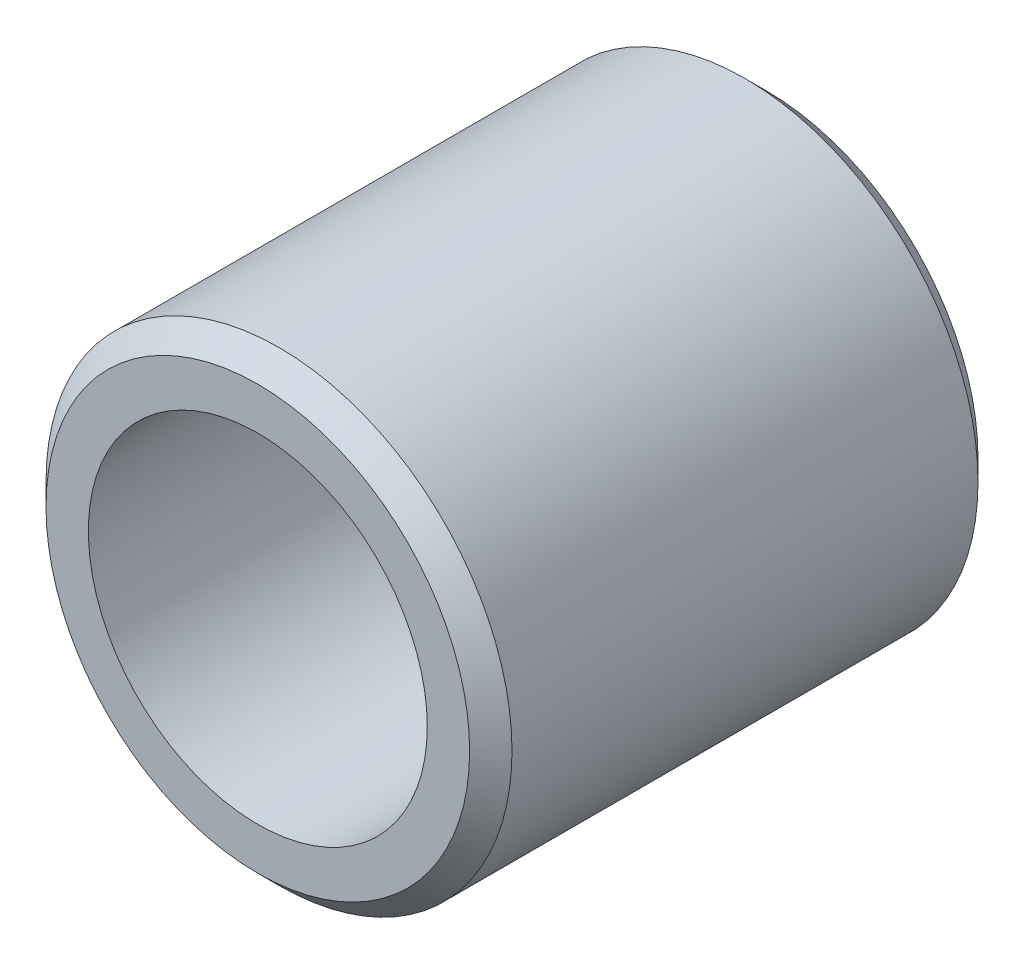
ISO-10303-21;
HEADER;
FILE_DESCRIPTION(('STEP AP214'),'2;1');
FILE_NAME('part.step','',(''),(''),'','','');
FILE_SCHEMA(('AUTOMOTIVE_DESIGN { 1 0 10303 214 1 1 1 1 }'));
ENDSEC;
DATA;
#1=APPLICATION_CONTEXT('core data for automotive mechanical design processes');
#2=APPLICATION_PROTOCOL_DEFINITION('international standard','automotive_design',2000,#1);
#3=PRODUCT_CONTEXT('',#1,'mechanical');
#4=PRODUCT('Part','Part','',(#3));
#5=PRODUCT_RELATED_PRODUCT_CATEGORY('part','',(#4));
#6=PRODUCT_DEFINITION_FORMATION('','',#4);
#7=PRODUCT_DEFINITION_CONTEXT('part definition',#1,'design');
#8=PRODUCT_DEFINITION('design','',#6,#7);
#9=PRODUCT_DEFINITION_SHAPE('','',#8);
#10=(LENGTH_UNIT() NAMED_UNIT(*) SI_UNIT(.MILLI.,.METRE.));
#11=(NAMED_UNIT(*) PLANE_ANGLE_UNIT() SI_UNIT($,.RADIAN.));
#12=(NAMED_UNIT(*) SI_UNIT($,.STERADIAN.) SOLID_ANGLE_UNIT());
#13=UNCERTAINTY_MEASURE_WITH_UNIT(LENGTH_MEASURE(1.E-05),#10,'distance_accuracy_value','');
#14=(GEOMETRIC_REPRESENTATION_CONTEXT(3) GLOBAL_UNCERTAINTY_ASSIGNED_CONTEXT((#13)) GLOBAL_UNIT_ASSIGNED_CONTEXT((#10,
#11,#12)) REPRESENTATION_CONTEXT('',''));
#15=CARTESIAN_POINT('',(0.,0.,0.));
#16=DIRECTION('',(0.,0.,1.));
#17=DIRECTION('',(1.,0.,0.));
#18=AXIS2_PLACEMENT_3D('',#15,#16,#17);
#19=CARTESIAN_POINT('',(0.,0.,6.00000000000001));
#20=DIRECTION('',(0.,0.,1.));
#21=DIRECTION('',(1.,0.,0.));
#22=AXIS2_PLACEMENT_3D('',#19,#20,#21);
#23=PLANE('',#22);
#24=CARTESIAN_POINT('',(0.,0.,6.00000000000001));
#25=DIRECTION('',(0.,0.,1.));
#26=DIRECTION('',(1.,0.,0.));
#27=AXIS2_PLACEMENT_3D('',#24,#25,#26);
#28=CIRCLE('',#27,2.5);
#29=CARTESIAN_POINT('',(2.50000000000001,0.,6.));
#30=VERTEX_POINT('',#29);
#31=EDGE_CURVE('E12',#30,#30,#28,.T.);
#32=ORIENTED_EDGE('',*,*,#31,.T.);
#33=EDGE_LOOP('',(#32));
#34=FACE_BOUND('',#33,.T.);
#35=CARTESIAN_POINT('',(0.,0.,6.00000000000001));
#36=DIRECTION('',(0.,0.,1.));
#37=DIRECTION('',(1.,0.,0.));
#38=AXIS2_PLACEMENT_3D('',#35,#36,#37);
#39=CIRCLE('',#38,2.);
#40=CARTESIAN_POINT('',(2.00000000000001,0.,6.00000000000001));
#41=VERTEX_POINT('',#40);
#42=EDGE_CURVE('E376',#41,#41,#39,.T.);
#43=ORIENTED_EDGE('',*,*,#42,.F.);
#44=EDGE_LOOP('',(#43));
#45=FACE_BOUND('',#44,.T.);
#46=ADVANCED_FACE('F356',(#34,#45),#23,.T.);
#47=CARTESIAN_POINT('',(0.,0.,0.));
#48=DIRECTION('',(0.,0.,1.));
#49=DIRECTION('',(1.,0.,0.));
#50=AXIS2_PLACEMENT_3D('',#47,#48,#49);
#51=PLANE('',#50);
#52=CARTESIAN_POINT('',(0.,0.,0.));
#53=DIRECTION('',(0.,0.,1.));
#54=DIRECTION('',(1.,0.,0.));
#55=AXIS2_PLACEMENT_3D('',#52,#53,#54);
#56=CIRCLE('',#55,2.5);
#57=CARTESIAN_POINT('',(2.5,0.,0.));
#58=VERTEX_POINT('',#57);
#59=EDGE_CURVE('E363',#58,#58,#56,.F.);
#60=ORIENTED_EDGE('',*,*,#59,.T.);
#61=EDGE_LOOP('',(#60));
#62=FACE_BOUND('',#61,.T.);
#63=CARTESIAN_POINT('',(0.,0.,0.));
#64=DIRECTION('',(0.,0.,1.));
#65=DIRECTION('',(1.,0.,0.));
#66=AXIS2_PLACEMENT_3D('',#63,#64,#65);
#67=CIRCLE('',#66,2.);
#68=CARTESIAN_POINT('',(2.,0.,0.));
#69=VERTEX_POINT('',#68);
#70=EDGE_CURVE('E379',#69,#69,#67,.T.);
#71=ORIENTED_EDGE('',*,*,#70,.T.);
#72=EDGE_LOOP('',(#71));
#73=FACE_BOUND('',#72,.T.);
#74=ADVANCED_FACE('F383',(#62,#73),#51,.F.);
#75=CARTESIAN_POINT('',(0.,0.,6.00000000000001));
#76=DIRECTION('',(0.,0.,-1.));
#77=DIRECTION('',(-1.,0.,0.));
#78=AXIS2_PLACEMENT_3D('',#75,#76,#77);
#79=CYLINDRICAL_SURFACE('',#78,2.75);
#80=CARTESIAN_POINT('',(0.,0.,0.250000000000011));
#81=DIRECTION('',(0.,0.,1.));
#82=DIRECTION('',(1.,0.,0.));
#83=AXIS2_PLACEMENT_3D('',#80,#81,#82);
#84=CIRCLE('',#83,2.75);
#85=CARTESIAN_POINT('',(2.75,0.,0.250000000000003));
#86=VERTEX_POINT('',#85);
#87=EDGE_CURVE('E367',#86,#86,#84,.T.);
#88=ORIENTED_EDGE('',*,*,#87,.T.);
#89=EDGE_LOOP('',(#88));
#90=FACE_BOUND('',#89,.T.);
#91=CARTESIAN_POINT('',(0.,0.,5.75000000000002));
#92=DIRECTION('',(0.,0.,1.));
#93=DIRECTION('',(1.,0.,0.));
#94=AXIS2_PLACEMENT_3D('',#91,#92,#93);
#95=CIRCLE('',#94,2.75);
#96=CARTESIAN_POINT('',(2.75,0.,5.75000000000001));
#97=VERTEX_POINT('',#96);
#98=EDGE_CURVE('E371',#97,#97,#95,.F.);
#99=ORIENTED_EDGE('',*,*,#98,.T.);
#100=EDGE_LOOP('',(#99));
#101=FACE_BOUND('',#100,.T.);
#102=ADVANCED_FACE('F358',(#90,#101),#79,.T.);
#103=CARTESIAN_POINT('',(0.,0.,6.00000000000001));
#104=DIRECTION('',(0.,0.,-1.));
#105=DIRECTION('',(-1.,0.,0.));
#106=AXIS2_PLACEMENT_3D('',#103,#104,#105);
#107=CYLINDRICAL_SURFACE('',#106,2.);
#108=ORIENTED_EDGE('',*,*,#42,.T.);
#109=EDGE_LOOP('',(#108));
#110=FACE_BOUND('',#109,.T.);
#111=ORIENTED_EDGE('',*,*,#70,.F.);
#112=EDGE_LOOP('',(#111));
#113=FACE_BOUND('',#112,.T.);
#114=ADVANCED_FACE('F385',(#110,#113),#107,.F.);
#115=CARTESIAN_POINT('',(0.,0.,0.250000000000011));
#116=DIRECTION('',(0.,0.,1.));
#117=DIRECTION('',(1.,0.,0.));
#118=AXIS2_PLACEMENT_3D('',#115,#116,#117);
#119=CONICAL_SURFACE('',#118,2.75,0.78539816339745);
#120=ORIENTED_EDGE('',*,*,#59,.F.);
#121=EDGE_LOOP('',(#120));
#122=FACE_BOUND('',#121,.T.);
#123=ORIENTED_EDGE('',*,*,#87,.F.);
#124=EDGE_LOOP('',(#123));
#125=FACE_BOUND('',#124,.T.);
#126=ADVANCED_FACE('F387',(#122,#125),#119,.T.);
#127=CARTESIAN_POINT('',(0.,0.,6.00000000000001));
#128=DIRECTION('',(0.,0.,-1.));
#129=DIRECTION('',(-1.,0.,0.));
#130=AXIS2_PLACEMENT_3D('',#127,#128,#129);
#131=CONICAL_SURFACE('',#130,2.5,0.785398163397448);
#132=ORIENTED_EDGE('',*,*,#98,.F.);
#133=EDGE_LOOP('',(#132));
#134=FACE_BOUND('',#133,.T.);
#135=ORIENTED_EDGE('',*,*,#31,.F.);
#136=EDGE_LOOP('',(#135));
#137=FACE_BOUND('',#136,.T.);
#138=ADVANCED_FACE('F394',(#134,#137),#131,.T.);
#139=CLOSED_SHELL('',(#46,#74,#102,#114,#126,#138));
#140=MANIFOLD_SOLID_BREP('B2',#139);
#141=ADVANCED_BREP_SHAPE_REPRESENTATION('',(#18,#140),#14);
#142=SHAPE_DEFINITION_REPRESENTATION(#9,#141);
ENDSEC;
END-ISO-10303-21;
